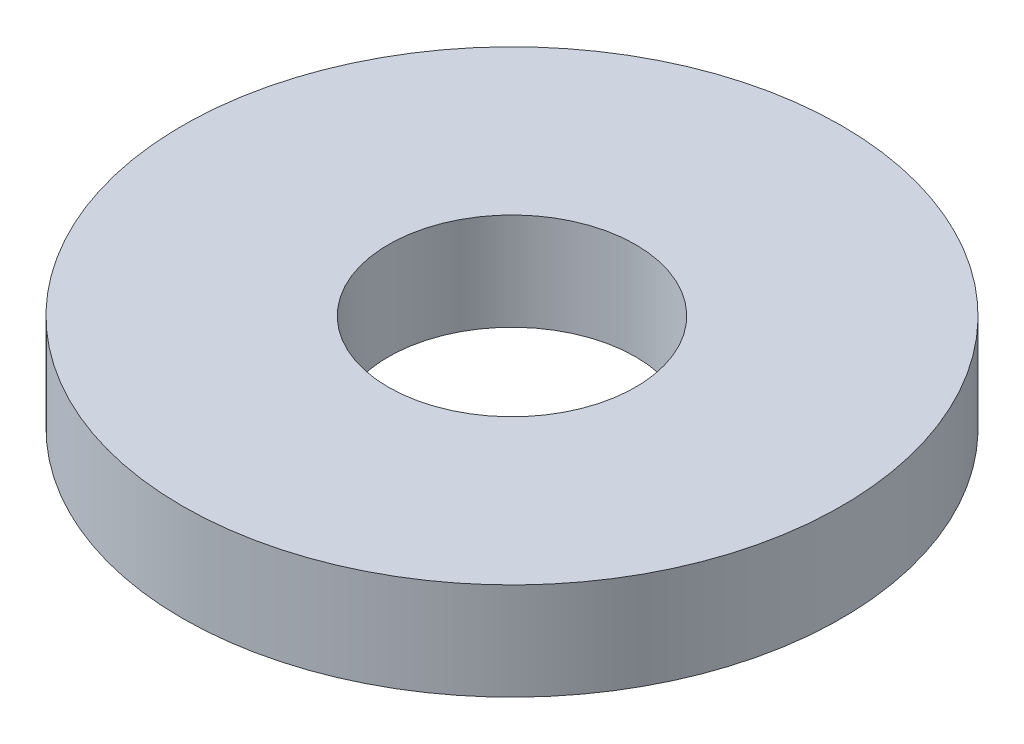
ISO-10303-21;
HEADER;
FILE_DESCRIPTION(('STEP AP214'),'2;1');
FILE_NAME('part.step','',(''),(''),'','','');
FILE_SCHEMA(('AUTOMOTIVE_DESIGN { 1 0 10303 214 1 1 1 1 }'));
ENDSEC;
DATA;
#1=APPLICATION_CONTEXT('core data for automotive mechanical design processes');
#2=APPLICATION_PROTOCOL_DEFINITION('international standard','automotive_design',2000,#1);
#3=PRODUCT_CONTEXT('',#1,'mechanical');
#4=PRODUCT('Part','Part','',(#3));
#5=PRODUCT_RELATED_PRODUCT_CATEGORY('part','',(#4));
#6=PRODUCT_DEFINITION_FORMATION('','',#4);
#7=PRODUCT_DEFINITION_CONTEXT('part definition',#1,'design');
#8=PRODUCT_DEFINITION('design','',#6,#7);
#9=PRODUCT_DEFINITION_SHAPE('','',#8);
#10=(LENGTH_UNIT() NAMED_UNIT(*) SI_UNIT(.MILLI.,.METRE.));
#11=(NAMED_UNIT(*) PLANE_ANGLE_UNIT() SI_UNIT($,.RADIAN.));
#12=(NAMED_UNIT(*) SI_UNIT($,.STERADIAN.) SOLID_ANGLE_UNIT());
#13=UNCERTAINTY_MEASURE_WITH_UNIT(LENGTH_MEASURE(1.E-05),#10,'distance_accuracy_value','');
#14=(GEOMETRIC_REPRESENTATION_CONTEXT(3) GLOBAL_UNCERTAINTY_ASSIGNED_CONTEXT((#13)) GLOBAL_UNIT_ASSIGNED_CONTEXT((#10,
#11,#12)) REPRESENTATION_CONTEXT('',''));
#15=CARTESIAN_POINT('',(0.,0.,0.));
#16=DIRECTION('',(0.,0.,1.));
#17=DIRECTION('',(1.,0.,0.));
#18=AXIS2_PLACEMENT_3D('',#15,#16,#17);
#19=CARTESIAN_POINT('',(0.,2.9972,0.));
#20=DIRECTION('',(0.,1.,0.));
#21=DIRECTION('',(0.,0.,1.));
#22=AXIS2_PLACEMENT_3D('',#19,#20,#21);
#23=PLANE('',#22);
#24=CARTESIAN_POINT('',(0.,2.9972,0.));
#25=DIRECTION('',(0.,1.,0.));
#26=DIRECTION('',(0.,0.,1.));
#27=AXIS2_PLACEMENT_3D('',#24,#25,#26);
#28=CIRCLE('',#27,10.16);
#29=CARTESIAN_POINT('',(0.,2.9972,-10.16));
#30=VERTEX_POINT('',#29);
#31=EDGE_CURVE('E10',#30,#30,#28,.T.);
#32=ORIENTED_EDGE('',*,*,#31,.T.);
#33=EDGE_LOOP('',(#32));
#34=FACE_BOUND('',#33,.T.);
#35=CARTESIAN_POINT('',(0.,2.9972,0.));
#36=DIRECTION('',(0.,1.,0.));
#37=DIRECTION('',(0.,0.,1.));
#38=AXIS2_PLACEMENT_3D('',#35,#36,#37);
#39=CIRCLE('',#38,3.81);
#40=CARTESIAN_POINT('',(0.,2.9972,-3.81));
#41=VERTEX_POINT('',#40);
#42=EDGE_CURVE('E42',#41,#41,#39,.T.);
#43=ORIENTED_EDGE('',*,*,#42,.F.);
#44=EDGE_LOOP('',(#43));
#45=FACE_BOUND('',#44,.T.);
#46=ADVANCED_FACE('F31',(#34,#45),#23,.T.);
#47=CARTESIAN_POINT('',(0.,0.,0.));
#48=DIRECTION('',(0.,1.,0.));
#49=DIRECTION('',(0.,0.,1.));
#50=AXIS2_PLACEMENT_3D('',#47,#48,#49);
#51=PLANE('',#50);
#52=CARTESIAN_POINT('',(0.,0.,0.));
#53=DIRECTION('',(0.,1.,0.));
#54=DIRECTION('',(0.,0.,1.));
#55=AXIS2_PLACEMENT_3D('',#52,#53,#54);
#56=CIRCLE('',#55,10.16);
#57=CARTESIAN_POINT('',(0.,0.,-10.16));
#58=VERTEX_POINT('',#57);
#59=EDGE_CURVE('E35',#58,#58,#56,.T.);
#60=ORIENTED_EDGE('',*,*,#59,.F.);
#61=EDGE_LOOP('',(#60));
#62=FACE_BOUND('',#61,.T.);
#63=CARTESIAN_POINT('',(0.,0.,0.));
#64=DIRECTION('',(0.,1.,0.));
#65=DIRECTION('',(0.,0.,1.));
#66=AXIS2_PLACEMENT_3D('',#63,#64,#65);
#67=CIRCLE('',#66,3.81);
#68=CARTESIAN_POINT('',(0.,0.,-3.81));
#69=VERTEX_POINT('',#68);
#70=EDGE_CURVE('E44',#69,#69,#67,.T.);
#71=ORIENTED_EDGE('',*,*,#70,.T.);
#72=EDGE_LOOP('',(#71));
#73=FACE_BOUND('',#72,.T.);
#74=ADVANCED_FACE('F54',(#62,#73),#51,.F.);
#75=CARTESIAN_POINT('',(0.,2.9972,0.));
#76=DIRECTION('',(0.,-1.,0.));
#77=DIRECTION('',(0.,0.,-1.));
#78=AXIS2_PLACEMENT_3D('',#75,#76,#77);
#79=CYLINDRICAL_SURFACE('',#78,10.16);
#80=CARTESIAN_POINT('',(0.,2.9972,-10.16));
#81=CARTESIAN_POINT('',(0.,2.96597916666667,-10.16));
#82=CARTESIAN_POINT('',(0.,2.93475833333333,-10.16));
#83=CARTESIAN_POINT('',(0.,2.87231666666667,-10.16));
#84=CARTESIAN_POINT('',(0.,2.84109583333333,-10.16));
#85=CARTESIAN_POINT('',(0.,2.77865416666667,-10.16));
#86=CARTESIAN_POINT('',(0.,2.74743333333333,-10.16));
#87=CARTESIAN_POINT('',(0.,2.68499166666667,-10.16));
#88=CARTESIAN_POINT('',(0.,2.65377083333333,-10.16));
#89=CARTESIAN_POINT('',(0.,2.59132916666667,-10.16));
#90=CARTESIAN_POINT('',(0.,2.56010833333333,-10.16));
#91=CARTESIAN_POINT('',(0.,2.49766666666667,-10.16));
#92=CARTESIAN_POINT('',(0.,2.46644583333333,-10.16));
#93=CARTESIAN_POINT('',(0.,2.40400416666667,-10.16));
#94=CARTESIAN_POINT('',(0.,2.37278333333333,-10.16));
#95=CARTESIAN_POINT('',(0.,2.31034166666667,-10.16));
#96=CARTESIAN_POINT('',(0.,2.27912083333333,-10.16));
#97=CARTESIAN_POINT('',(0.,2.21667916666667,-10.16));
#98=CARTESIAN_POINT('',(0.,2.18545833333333,-10.16));
#99=CARTESIAN_POINT('',(0.,2.12301666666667,-10.16));
#100=CARTESIAN_POINT('',(0.,2.09179583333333,-10.16));
#101=CARTESIAN_POINT('',(0.,2.02935416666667,-10.16));
#102=CARTESIAN_POINT('',(0.,1.99813333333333,-10.16));
#103=CARTESIAN_POINT('',(0.,1.93569166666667,-10.16));
#104=CARTESIAN_POINT('',(0.,1.90447083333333,-10.16));
#105=CARTESIAN_POINT('',(0.,1.84202916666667,-10.16));
#106=CARTESIAN_POINT('',(0.,1.81080833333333,-10.16));
#107=CARTESIAN_POINT('',(0.,1.74836666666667,-10.16));
#108=CARTESIAN_POINT('',(0.,1.71714583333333,-10.16));
#109=CARTESIAN_POINT('',(0.,1.65470416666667,-10.16));
#110=CARTESIAN_POINT('',(0.,1.62348333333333,-10.16));
#111=CARTESIAN_POINT('',(0.,1.56104166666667,-10.16));
#112=CARTESIAN_POINT('',(0.,1.52982083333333,-10.16));
#113=CARTESIAN_POINT('',(0.,1.46737916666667,-10.16));
#114=CARTESIAN_POINT('',(0.,1.43615833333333,-10.16));
#115=CARTESIAN_POINT('',(0.,1.37371666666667,-10.16));
#116=CARTESIAN_POINT('',(0.,1.34249583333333,-10.16));
#117=CARTESIAN_POINT('',(0.,1.28005416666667,-10.16));
#118=CARTESIAN_POINT('',(0.,1.24883333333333,-10.16));
#119=CARTESIAN_POINT('',(0.,1.18639166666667,-10.16));
#120=CARTESIAN_POINT('',(0.,1.15517083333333,-10.16));
#121=CARTESIAN_POINT('',(0.,1.09272916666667,-10.16));
#122=CARTESIAN_POINT('',(0.,1.06150833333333,-10.16));
#123=CARTESIAN_POINT('',(0.,0.999066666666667,-10.16));
#124=CARTESIAN_POINT('',(0.,0.967845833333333,-10.16));
#125=CARTESIAN_POINT('',(0.,0.905404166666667,-10.16));
#126=CARTESIAN_POINT('',(0.,0.874183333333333,-10.16));
#127=CARTESIAN_POINT('',(0.,0.811741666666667,-10.16));
#128=CARTESIAN_POINT('',(0.,0.780520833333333,-10.16));
#129=CARTESIAN_POINT('',(0.,0.718079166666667,-10.16));
#130=CARTESIAN_POINT('',(0.,0.686858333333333,-10.16));
#131=CARTESIAN_POINT('',(0.,0.624416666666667,-10.16));
#132=CARTESIAN_POINT('',(0.,0.593195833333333,-10.16));
#133=CARTESIAN_POINT('',(0.,0.530754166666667,-10.16));
#134=CARTESIAN_POINT('',(0.,0.499533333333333,-10.16));
#135=CARTESIAN_POINT('',(0.,0.437091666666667,-10.16));
#136=CARTESIAN_POINT('',(0.,0.405870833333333,-10.16));
#137=CARTESIAN_POINT('',(0.,0.343429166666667,-10.16));
#138=CARTESIAN_POINT('',(0.,0.312208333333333,-10.16));
#139=CARTESIAN_POINT('',(0.,0.249766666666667,-10.16));
#140=CARTESIAN_POINT('',(0.,0.218545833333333,-10.16));
#141=CARTESIAN_POINT('',(0.,0.156104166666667,-10.16));
#142=CARTESIAN_POINT('',(0.,0.124883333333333,-10.16));
#143=CARTESIAN_POINT('',(0.,0.0624416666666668,-10.16));
#144=CARTESIAN_POINT('',(0.,0.0312208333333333,-10.16));
#145=CARTESIAN_POINT('',(0.,0.,-10.16));
#146=B_SPLINE_CURVE_WITH_KNOTS('',3,(#80,#81,#82,#83,#84,#85,#86,#87,#88,#89,#90,#91,#92,#93,
#94,#95,#96,#97,#98,#99,#100,#101,#102,#103,#104,#105,#106,#107,#108,#109,#110,#111,#112,#113,
#114,#115,#116,#117,#118,#119,#120,#121,#122,#123,#124,#125,#126,#127,#128,#129,#130,#131,#132,
#133,#134,#135,#136,#137,#138,#139,#140,#141,#142,#143,#144,#145),.UNSPECIFIED.,.F.,.F.,(4,2,2,
2,2,2,2,2,2,2,2,2,2,2,2,2,2,2,2,2,2,2,2,2,2,2,2,2,2,2,2,2,4),(0.,0.0936624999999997,0.187325,
0.2809875,0.37465,0.4683125,0.561975,0.655637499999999,0.7493,0.8429625,0.936624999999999,
1.0302875,1.12395,1.2176125,1.311275,1.4049375,1.4986,1.5922625,1.685925,1.7795875,1.87325,
1.9669125,2.060575,2.1542375,2.2479,2.3415625,2.435225,2.5288875,2.62255,2.7162125,2.809875,
2.9035375,2.9972),.UNSPECIFIED.);
#147=EDGE_CURVE('BSEAM33',#30,#58,#146,.T.);
#148=ORIENTED_EDGE('',*,*,#31,.F.);
#149=ORIENTED_EDGE('',*,*,#59,.T.);
#150=ORIENTED_EDGE('',*,*,#147,.T.);
#151=ORIENTED_EDGE('',*,*,#147,.F.);
#152=EDGE_LOOP('',(#148,#150,#149,#151));
#153=FACE_BOUND('',#152,.T.);
#154=ADVANCED_FACE('F33',(#153),#79,.T.);
#155=CARTESIAN_POINT('',(0.,2.9972,0.));
#156=DIRECTION('',(0.,-1.,0.));
#157=DIRECTION('',(0.,0.,-1.));
#158=AXIS2_PLACEMENT_3D('',#155,#156,#157);
#159=CYLINDRICAL_SURFACE('',#158,3.81);
#160=CARTESIAN_POINT('',(0.,2.9972,-3.81));
#161=CARTESIAN_POINT('',(0.,2.96597916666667,-3.81));
#162=CARTESIAN_POINT('',(0.,2.93475833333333,-3.81));
#163=CARTESIAN_POINT('',(0.,2.87231666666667,-3.81));
#164=CARTESIAN_POINT('',(0.,2.84109583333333,-3.81));
#165=CARTESIAN_POINT('',(0.,2.77865416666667,-3.81));
#166=CARTESIAN_POINT('',(0.,2.74743333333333,-3.81));
#167=CARTESIAN_POINT('',(0.,2.68499166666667,-3.81));
#168=CARTESIAN_POINT('',(0.,2.65377083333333,-3.81));
#169=CARTESIAN_POINT('',(0.,2.59132916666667,-3.81));
#170=CARTESIAN_POINT('',(0.,2.56010833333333,-3.81));
#171=CARTESIAN_POINT('',(0.,2.49766666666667,-3.81));
#172=CARTESIAN_POINT('',(0.,2.46644583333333,-3.81));
#173=CARTESIAN_POINT('',(0.,2.40400416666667,-3.81));
#174=CARTESIAN_POINT('',(0.,2.37278333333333,-3.81));
#175=CARTESIAN_POINT('',(0.,2.31034166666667,-3.81));
#176=CARTESIAN_POINT('',(0.,2.27912083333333,-3.81));
#177=CARTESIAN_POINT('',(0.,2.21667916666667,-3.81));
#178=CARTESIAN_POINT('',(0.,2.18545833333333,-3.81));
#179=CARTESIAN_POINT('',(0.,2.12301666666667,-3.81));
#180=CARTESIAN_POINT('',(0.,2.09179583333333,-3.81));
#181=CARTESIAN_POINT('',(0.,2.02935416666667,-3.81));
#182=CARTESIAN_POINT('',(0.,1.99813333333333,-3.81));
#183=CARTESIAN_POINT('',(0.,1.93569166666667,-3.81));
#184=CARTESIAN_POINT('',(0.,1.90447083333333,-3.81));
#185=CARTESIAN_POINT('',(0.,1.84202916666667,-3.81));
#186=CARTESIAN_POINT('',(0.,1.81080833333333,-3.81));
#187=CARTESIAN_POINT('',(0.,1.74836666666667,-3.81));
#188=CARTESIAN_POINT('',(0.,1.71714583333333,-3.81));
#189=CARTESIAN_POINT('',(0.,1.65470416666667,-3.81));
#190=CARTESIAN_POINT('',(0.,1.62348333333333,-3.81));
#191=CARTESIAN_POINT('',(0.,1.56104166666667,-3.81));
#192=CARTESIAN_POINT('',(0.,1.52982083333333,-3.81));
#193=CARTESIAN_POINT('',(0.,1.46737916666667,-3.81));
#194=CARTESIAN_POINT('',(0.,1.43615833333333,-3.81));
#195=CARTESIAN_POINT('',(0.,1.37371666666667,-3.81));
#196=CARTESIAN_POINT('',(0.,1.34249583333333,-3.81));
#197=CARTESIAN_POINT('',(0.,1.28005416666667,-3.81));
#198=CARTESIAN_POINT('',(0.,1.24883333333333,-3.81));
#199=CARTESIAN_POINT('',(0.,1.18639166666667,-3.81));
#200=CARTESIAN_POINT('',(0.,1.15517083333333,-3.81));
#201=CARTESIAN_POINT('',(0.,1.09272916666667,-3.81));
#202=CARTESIAN_POINT('',(0.,1.06150833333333,-3.81));
#203=CARTESIAN_POINT('',(0.,0.999066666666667,-3.81));
#204=CARTESIAN_POINT('',(0.,0.967845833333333,-3.81));
#205=CARTESIAN_POINT('',(0.,0.905404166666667,-3.81));
#206=CARTESIAN_POINT('',(0.,0.874183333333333,-3.81));
#207=CARTESIAN_POINT('',(0.,0.811741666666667,-3.81));
#208=CARTESIAN_POINT('',(0.,0.780520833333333,-3.81));
#209=CARTESIAN_POINT('',(0.,0.718079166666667,-3.81));
#210=CARTESIAN_POINT('',(0.,0.686858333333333,-3.81));
#211=CARTESIAN_POINT('',(0.,0.624416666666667,-3.81));
#212=CARTESIAN_POINT('',(0.,0.593195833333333,-3.81));
#213=CARTESIAN_POINT('',(0.,0.530754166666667,-3.81));
#214=CARTESIAN_POINT('',(0.,0.499533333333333,-3.81));
#215=CARTESIAN_POINT('',(0.,0.437091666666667,-3.81));
#216=CARTESIAN_POINT('',(0.,0.405870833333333,-3.81));
#217=CARTESIAN_POINT('',(0.,0.343429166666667,-3.81));
#218=CARTESIAN_POINT('',(0.,0.312208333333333,-3.81));
#219=CARTESIAN_POINT('',(0.,0.249766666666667,-3.81));
#220=CARTESIAN_POINT('',(0.,0.218545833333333,-3.81));
#221=CARTESIAN_POINT('',(0.,0.156104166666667,-3.81));
#222=CARTESIAN_POINT('',(0.,0.124883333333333,-3.81));
#223=CARTESIAN_POINT('',(0.,0.0624416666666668,-3.81));
#224=CARTESIAN_POINT('',(0.,0.0312208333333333,-3.81));
#225=CARTESIAN_POINT('',(0.,0.,-3.81));
#226=B_SPLINE_CURVE_WITH_KNOTS('',3,(#160,#161,#162,#163,#164,#165,#166,#167,#168,#169,#170,
#171,#172,#173,#174,#175,#176,#177,#178,#179,#180,#181,#182,#183,#184,#185,#186,#187,#188,#189,
#190,#191,#192,#193,#194,#195,#196,#197,#198,#199,#200,#201,#202,#203,#204,#205,#206,#207,#208,
#209,#210,#211,#212,#213,#214,#215,#216,#217,#218,#219,#220,#221,#222,#223,#224,#225),
.UNSPECIFIED.,.F.,.F.,(4,2,2,2,2,2,2,2,2,2,2,2,2,2,2,2,2,2,2,2,2,2,2,2,2,2,2,2,2,2,2,2,4),(0.,
0.0936624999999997,0.187325,0.2809875,0.37465,0.4683125,0.561975,0.655637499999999,0.7493,
0.8429625,0.936624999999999,1.0302875,1.12395,1.2176125,1.311275,1.4049375,1.4986,1.5922625,
1.685925,1.7795875,1.87325,1.9669125,2.060575,2.1542375,2.2479,2.3415625,2.435225,2.5288875,
2.62255,2.7162125,2.809875,2.9035375,2.9972),.UNSPECIFIED.);
#227=EDGE_CURVE('BSEAM50',#41,#69,#226,.T.);
#228=ORIENTED_EDGE('',*,*,#42,.T.);
#229=ORIENTED_EDGE('',*,*,#70,.F.);
#230=ORIENTED_EDGE('',*,*,#227,.T.);
#231=ORIENTED_EDGE('',*,*,#227,.F.);
#232=EDGE_LOOP('',(#228,#230,#229,#231));
#233=FACE_BOUND('',#232,.T.);
#234=ADVANCED_FACE('F50',(#233),#159,.F.);
#235=CLOSED_SHELL('',(#46,#74,#154,#234));
#236=MANIFOLD_SOLID_BREP('B2',#235);
#237=ADVANCED_BREP_SHAPE_REPRESENTATION('',(#18,#236),#14);
#238=SHAPE_DEFINITION_REPRESENTATION(#9,#237);
ENDSEC;
END-ISO-10303-21;
